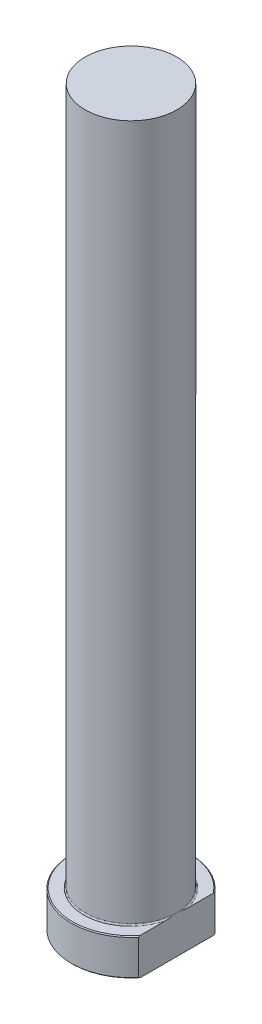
from build123d import *
from build123d.topology import SkipClean

# Parameters (mm, degrees)
CHAMFER1_SIZE = 0.2
FILLET1_R     = 0.3
KEY_DEPTH     = 162.052786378


with BuildPart() as part:
    # Sketch1 → Revolve1 (revolve)
    with BuildSketch(Plane.XY, mode=Mode.PRIVATE) as revolve1_sk:
        Polygon((0, 0), (-13, 0), (-13, 8), (-10, 8), (-10, 160), (0, 160), align=None)
    revolve(revolve1_sk.sketch.rotate(Axis((0, 259.958771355, 0), (0, -1, 0)), 270), axis=Axis((0, 259.958771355, 0), (0, -1, 0)))

    # Chamfer1
    chamfer1_edges = [part.edges().sort_by_distance(p)[0] for p in [
        (0, 8, -13),
        (0, 0, -13),
    ]]
    chamfer(chamfer1_edges, length=CHAMFER1_SIZE)

    # Fillet1
    fillet1_edges = [part.edges().sort_by_distance(p)[0] for p in [
        (0, 8, -10),
    ]]
    fillet(fillet1_edges, radius=FILLET1_R)

    # Sketch2 → KEY (cut, through all)
    with SkipClean():  # the faces are left unmerged after this step: merging them gives an invalid solid
        with BuildSketch(Plane(origin=(0, 0, 0), x_dir=(1, 0, 0), z_dir=(0, 1, 0))):
            with BuildLine():
                Line((10, 8.306623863), (10, -8.306623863))
                ThreePointArc((10, -8.306623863), (13, 0), (10, 8.306623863))
            make_face()
        extrude(amount=KEY_DEPTH, mode=Mode.SUBTRACT)


solid = part.part
